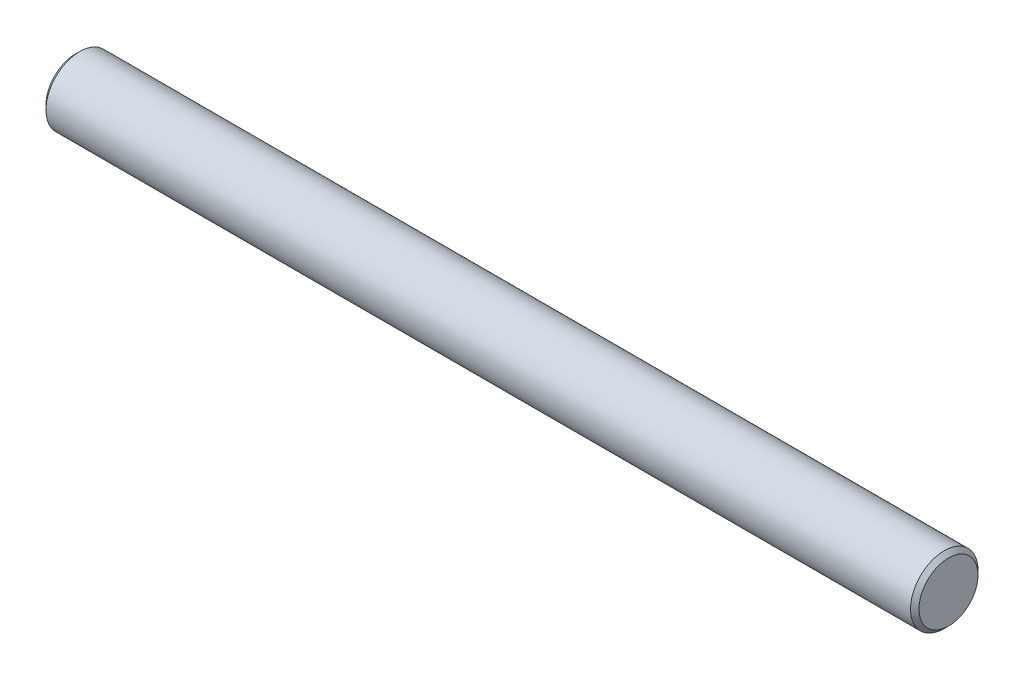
ISO-10303-21;
HEADER;
FILE_DESCRIPTION(('STEP AP214'),'2;1');
FILE_NAME('part.step','',(''),(''),'','','');
FILE_SCHEMA(('AUTOMOTIVE_DESIGN { 1 0 10303 214 1 1 1 1 }'));
ENDSEC;
DATA;
#1=APPLICATION_CONTEXT('core data for automotive mechanical design processes');
#2=APPLICATION_PROTOCOL_DEFINITION('international standard','automotive_design',2000,#1);
#3=PRODUCT_CONTEXT('',#1,'mechanical');
#4=PRODUCT('Part','Part','',(#3));
#5=PRODUCT_RELATED_PRODUCT_CATEGORY('part','',(#4));
#6=PRODUCT_DEFINITION_FORMATION('','',#4);
#7=PRODUCT_DEFINITION_CONTEXT('part definition',#1,'design');
#8=PRODUCT_DEFINITION('design','',#6,#7);
#9=PRODUCT_DEFINITION_SHAPE('','',#8);
#10=(LENGTH_UNIT() NAMED_UNIT(*) SI_UNIT(.MILLI.,.METRE.));
#11=(NAMED_UNIT(*) PLANE_ANGLE_UNIT() SI_UNIT($,.RADIAN.));
#12=(NAMED_UNIT(*) SI_UNIT($,.STERADIAN.) SOLID_ANGLE_UNIT());
#13=UNCERTAINTY_MEASURE_WITH_UNIT(LENGTH_MEASURE(1.E-05),#10,'distance_accuracy_value','');
#14=(GEOMETRIC_REPRESENTATION_CONTEXT(3) GLOBAL_UNCERTAINTY_ASSIGNED_CONTEXT((#13)) GLOBAL_UNIT_ASSIGNED_CONTEXT((#10,
#11,#12)) REPRESENTATION_CONTEXT('',''));
#15=CARTESIAN_POINT('',(0.,0.,0.));
#16=DIRECTION('',(0.,0.,1.));
#17=DIRECTION('',(1.,0.,0.));
#18=AXIS2_PLACEMENT_3D('',#15,#16,#17);
#19=CARTESIAN_POINT('',(207.,0.,0.));
#20=DIRECTION('',(-1.,0.,0.));
#21=DIRECTION('',(0.,0.,1.));
#22=AXIS2_PLACEMENT_3D('',#19,#20,#21);
#23=CYLINDRICAL_SURFACE('',#22,8.);
#24=CARTESIAN_POINT('',(206.,0.,0.));
#25=DIRECTION('',(1.,0.,0.));
#26=DIRECTION('',(0.,0.,-1.));
#27=AXIS2_PLACEMENT_3D('',#24,#25,#26);
#28=CIRCLE('',#27,8.);
#29=CARTESIAN_POINT('',(206.,0.,-8.));
#30=VERTEX_POINT('',#29);
#31=EDGE_CURVE('E9178',#30,#30,#28,.F.);
#32=ORIENTED_EDGE('',*,*,#31,.T.);
#33=EDGE_LOOP('',(#32));
#34=FACE_BOUND('',#33,.T.);
#35=CARTESIAN_POINT('',(1.,0.,0.));
#36=DIRECTION('',(1.,0.,0.));
#37=DIRECTION('',(0.,0.,-1.));
#38=AXIS2_PLACEMENT_3D('',#35,#36,#37);
#39=CIRCLE('',#38,8.);
#40=CARTESIAN_POINT('',(1.,0.,-8.));
#41=VERTEX_POINT('',#40);
#42=EDGE_CURVE('E9182',#41,#41,#39,.T.);
#43=ORIENTED_EDGE('',*,*,#42,.T.);
#44=EDGE_LOOP('',(#43));
#45=FACE_BOUND('',#44,.T.);
#46=ADVANCED_FACE('F9172',(#34,#45),#23,.T.);
#47=CARTESIAN_POINT('',(207.,0.,0.));
#48=DIRECTION('',(1.,0.,0.));
#49=DIRECTION('',(0.,0.,-1.));
#50=AXIS2_PLACEMENT_3D('',#47,#48,#49);
#51=PLANE('',#50);
#52=CARTESIAN_POINT('',(207.,0.,0.));
#53=DIRECTION('',(1.,0.,0.));
#54=DIRECTION('',(0.,0.,-1.));
#55=AXIS2_PLACEMENT_3D('',#52,#53,#54);
#56=CIRCLE('',#55,7.);
#57=CARTESIAN_POINT('',(207.,0.,-7.));
#58=VERTEX_POINT('',#57);
#59=EDGE_CURVE('E9186',#58,#58,#56,.T.);
#60=ORIENTED_EDGE('',*,*,#59,.T.);
#61=EDGE_LOOP('',(#60));
#62=FACE_BOUND('',#61,.T.);
#63=ADVANCED_FACE('F9192',(#62),#51,.T.);
#64=CARTESIAN_POINT('',(0.,0.,0.));
#65=DIRECTION('',(1.,0.,0.));
#66=DIRECTION('',(0.,0.,-1.));
#67=AXIS2_PLACEMENT_3D('',#64,#65,#66);
#68=PLANE('',#67);
#69=CARTESIAN_POINT('',(0.,0.,0.));
#70=DIRECTION('',(1.,0.,0.));
#71=DIRECTION('',(0.,0.,-1.));
#72=AXIS2_PLACEMENT_3D('',#69,#70,#71);
#73=CIRCLE('',#72,7.);
#74=CARTESIAN_POINT('',(0.,0.,-7.));
#75=VERTEX_POINT('',#74);
#76=EDGE_CURVE('E10',#75,#75,#73,.F.);
#77=ORIENTED_EDGE('',*,*,#76,.T.);
#78=EDGE_LOOP('',(#77));
#79=FACE_BOUND('',#78,.T.);
#80=ADVANCED_FACE('F9197',(#79),#68,.F.);
#81=CARTESIAN_POINT('',(207.,0.,0.));
#82=DIRECTION('',(-1.,0.,0.));
#83=DIRECTION('',(0.,0.,1.));
#84=AXIS2_PLACEMENT_3D('',#81,#82,#83);
#85=CONICAL_SURFACE('',#84,7.,0.785398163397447);
#86=ORIENTED_EDGE('',*,*,#31,.F.);
#87=EDGE_LOOP('',(#86));
#88=FACE_BOUND('',#87,.T.);
#89=ORIENTED_EDGE('',*,*,#59,.F.);
#90=EDGE_LOOP('',(#89));
#91=FACE_BOUND('',#90,.T.);
#92=ADVANCED_FACE('F9194',(#88,#91),#85,.T.);
#93=CARTESIAN_POINT('',(1.,0.,0.));
#94=DIRECTION('',(1.,0.,0.));
#95=DIRECTION('',(0.,0.,-1.));
#96=AXIS2_PLACEMENT_3D('',#93,#94,#95);
#97=CONICAL_SURFACE('',#96,8.,0.785398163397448);
#98=ORIENTED_EDGE('',*,*,#76,.F.);
#99=EDGE_LOOP('',(#98));
#100=FACE_BOUND('',#99,.T.);
#101=ORIENTED_EDGE('',*,*,#42,.F.);
#102=EDGE_LOOP('',(#101));
#103=FACE_BOUND('',#102,.T.);
#104=ADVANCED_FACE('F9196',(#100,#103),#97,.T.);
#105=CLOSED_SHELL('',(#46,#63,#80,#92,#104));
#106=MANIFOLD_SOLID_BREP('B2',#105);
#107=ADVANCED_BREP_SHAPE_REPRESENTATION('',(#18,#106),#14);
#108=SHAPE_DEFINITION_REPRESENTATION(#9,#107);
ENDSEC;
END-ISO-10303-21;
